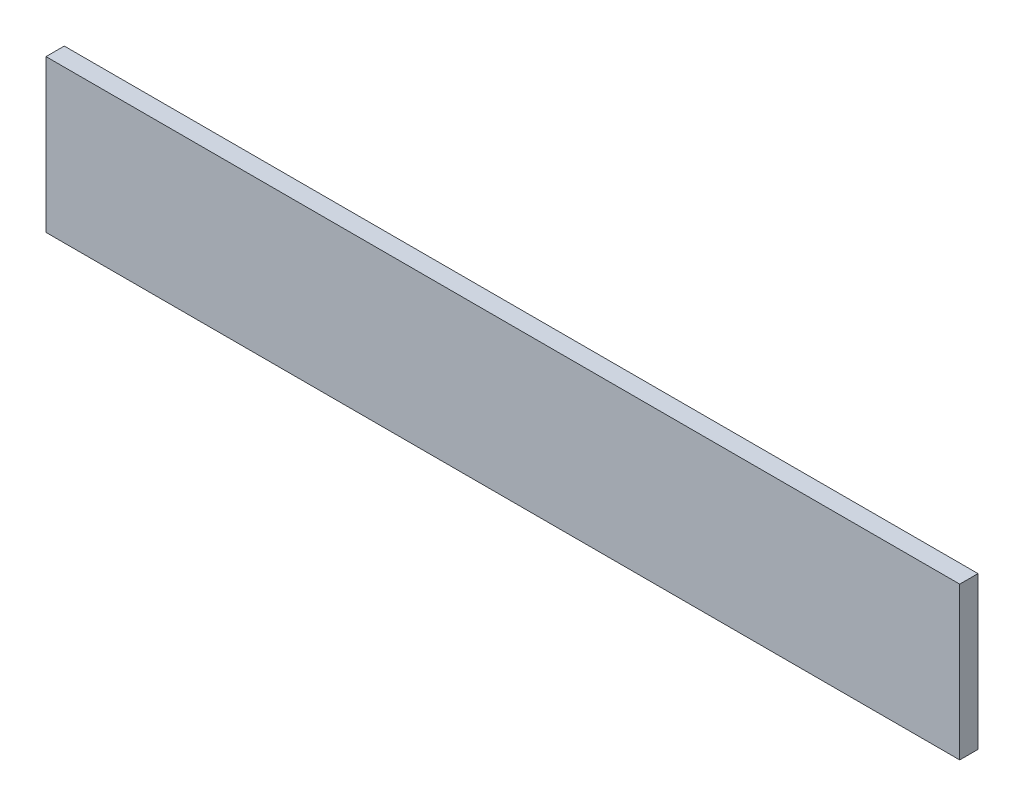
ISO-10303-21;
HEADER;
FILE_DESCRIPTION(('STEP AP214'),'2;1');
FILE_NAME('part.step','',(''),(''),'','','');
FILE_SCHEMA(('AUTOMOTIVE_DESIGN { 1 0 10303 214 1 1 1 1 }'));
ENDSEC;
DATA;
#1=APPLICATION_CONTEXT('core data for automotive mechanical design processes');
#2=APPLICATION_PROTOCOL_DEFINITION('international standard','automotive_design',2000,#1);
#3=PRODUCT_CONTEXT('',#1,'mechanical');
#4=PRODUCT('Part','Part','',(#3));
#5=PRODUCT_RELATED_PRODUCT_CATEGORY('part','',(#4));
#6=PRODUCT_DEFINITION_FORMATION('','',#4);
#7=PRODUCT_DEFINITION_CONTEXT('part definition',#1,'design');
#8=PRODUCT_DEFINITION('design','',#6,#7);
#9=PRODUCT_DEFINITION_SHAPE('','',#8);
#10=(LENGTH_UNIT() NAMED_UNIT(*) SI_UNIT(.MILLI.,.METRE.));
#11=(NAMED_UNIT(*) PLANE_ANGLE_UNIT() SI_UNIT($,.RADIAN.));
#12=(NAMED_UNIT(*) SI_UNIT($,.STERADIAN.) SOLID_ANGLE_UNIT());
#13=UNCERTAINTY_MEASURE_WITH_UNIT(LENGTH_MEASURE(1.E-05),#10,'distance_accuracy_value','');
#14=(GEOMETRIC_REPRESENTATION_CONTEXT(3) GLOBAL_UNCERTAINTY_ASSIGNED_CONTEXT((#13)) GLOBAL_UNIT_ASSIGNED_CONTEXT((#10,
#11,#12)) REPRESENTATION_CONTEXT('',''));
#15=CARTESIAN_POINT('',(0.,0.,0.));
#16=DIRECTION('',(0.,0.,1.));
#17=DIRECTION('',(1.,0.,0.));
#18=AXIS2_PLACEMENT_3D('',#15,#16,#17);
#19=CARTESIAN_POINT('',(-150.,50.,6.));
#20=DIRECTION('',(1.,0.,0.));
#21=DIRECTION('',(0.,0.,-1.));
#22=AXIS2_PLACEMENT_3D('',#19,#20,#21);
#23=PLANE('',#22);
#24=DIRECTION('',(0.,-1.,0.));
#25=VECTOR('',#24,1.);
#26=CARTESIAN_POINT('',(-150.,50.,0.));
#27=LINE('',#26,#25);
#28=CARTESIAN_POINT('',(-150.,50.,0.));
#29=VERTEX_POINT('',#28);
#30=CARTESIAN_POINT('',(-150.,0.,0.));
#31=VERTEX_POINT('',#30);
#32=EDGE_CURVE('E70',#29,#31,#27,.T.);
#33=ORIENTED_EDGE('',*,*,#32,.T.);
#34=DIRECTION('',(0.,0.,-1.));
#35=VECTOR('',#34,1.);
#36=CARTESIAN_POINT('',(-150.,0.,6.));
#37=LINE('',#36,#35);
#38=CARTESIAN_POINT('',(-150.,0.,6.));
#39=VERTEX_POINT('',#38);
#40=EDGE_CURVE('E11',#39,#31,#37,.T.);
#41=ORIENTED_EDGE('',*,*,#40,.F.);
#42=DIRECTION('',(0.,-1.,0.));
#43=VECTOR('',#42,1.);
#44=CARTESIAN_POINT('',(-150.,50.,6.));
#45=LINE('',#44,#43);
#46=CARTESIAN_POINT('',(-150.,50.,6.));
#47=VERTEX_POINT('',#46);
#48=EDGE_CURVE('E88',#47,#39,#45,.T.);
#49=ORIENTED_EDGE('',*,*,#48,.F.);
#50=DIRECTION('',(0.,0.,-1.));
#51=VECTOR('',#50,1.);
#52=CARTESIAN_POINT('',(-150.,50.,6.));
#53=LINE('',#52,#51);
#54=EDGE_CURVE('E82',#47,#29,#53,.T.);
#55=ORIENTED_EDGE('',*,*,#54,.T.);
#56=EDGE_LOOP('',(#33,#41,#49,#55));
#57=FACE_BOUND('',#56,.T.);
#58=ADVANCED_FACE('F26',(#57),#23,.F.);
#59=CARTESIAN_POINT('',(-150.,0.,6.));
#60=DIRECTION('',(0.,1.,0.));
#61=DIRECTION('',(0.,0.,1.));
#62=AXIS2_PLACEMENT_3D('',#59,#60,#61);
#63=PLANE('',#62);
#64=DIRECTION('',(1.,0.,0.));
#65=VECTOR('',#64,1.);
#66=CARTESIAN_POINT('',(-150.,0.,0.));
#67=LINE('',#66,#65);
#68=CARTESIAN_POINT('',(150.,0.,0.));
#69=VERTEX_POINT('',#68);
#70=EDGE_CURVE('E66',#31,#69,#67,.T.);
#71=ORIENTED_EDGE('',*,*,#70,.T.);
#72=DIRECTION('',(0.,0.,-1.));
#73=VECTOR('',#72,1.);
#74=CARTESIAN_POINT('',(150.,0.,6.));
#75=LINE('',#74,#73);
#76=CARTESIAN_POINT('',(150.,0.,6.));
#77=VERTEX_POINT('',#76);
#78=EDGE_CURVE('E33',#77,#69,#75,.T.);
#79=ORIENTED_EDGE('',*,*,#78,.F.);
#80=DIRECTION('',(1.,0.,0.));
#81=VECTOR('',#80,1.);
#82=CARTESIAN_POINT('',(-150.,0.,6.));
#83=LINE('',#82,#81);
#84=EDGE_CURVE('E78',#39,#77,#83,.T.);
#85=ORIENTED_EDGE('',*,*,#84,.F.);
#86=ORIENTED_EDGE('',*,*,#40,.T.);
#87=EDGE_LOOP('',(#71,#79,#85,#86));
#88=FACE_BOUND('',#87,.T.);
#89=ADVANCED_FACE('F77',(#88),#63,.F.);
#90=CARTESIAN_POINT('',(150.,50.,6.));
#91=DIRECTION('',(-1.,0.,0.));
#92=DIRECTION('',(0.,0.,1.));
#93=AXIS2_PLACEMENT_3D('',#90,#91,#92);
#94=PLANE('',#93);
#95=DIRECTION('',(0.,1.,0.));
#96=VECTOR('',#95,1.);
#97=CARTESIAN_POINT('',(150.,50.,0.));
#98=LINE('',#97,#96);
#99=CARTESIAN_POINT('',(150.,50.,0.));
#100=VERTEX_POINT('',#99);
#101=EDGE_CURVE('E71',#69,#100,#98,.T.);
#102=ORIENTED_EDGE('',*,*,#101,.T.);
#103=DIRECTION('',(0.,0.,-1.));
#104=VECTOR('',#103,1.);
#105=CARTESIAN_POINT('',(150.,50.,6.));
#106=LINE('',#105,#104);
#107=CARTESIAN_POINT('',(150.,50.,6.));
#108=VERTEX_POINT('',#107);
#109=EDGE_CURVE('E94',#108,#100,#106,.T.);
#110=ORIENTED_EDGE('',*,*,#109,.F.);
#111=DIRECTION('',(0.,1.,0.));
#112=VECTOR('',#111,1.);
#113=CARTESIAN_POINT('',(150.,50.,6.));
#114=LINE('',#113,#112);
#115=EDGE_CURVE('E45',#77,#108,#114,.T.);
#116=ORIENTED_EDGE('',*,*,#115,.F.);
#117=ORIENTED_EDGE('',*,*,#78,.T.);
#118=EDGE_LOOP('',(#102,#110,#116,#117));
#119=FACE_BOUND('',#118,.T.);
#120=ADVANCED_FACE('F97',(#119),#94,.F.);
#121=CARTESIAN_POINT('',(-150.,50.,6.));
#122=DIRECTION('',(0.,-1.,0.));
#123=DIRECTION('',(0.,0.,-1.));
#124=AXIS2_PLACEMENT_3D('',#121,#122,#123);
#125=PLANE('',#124);
#126=DIRECTION('',(-1.,0.,0.));
#127=VECTOR('',#126,1.);
#128=CARTESIAN_POINT('',(-150.,50.,0.));
#129=LINE('',#128,#127);
#130=EDGE_CURVE('E86',#100,#29,#129,.T.);
#131=ORIENTED_EDGE('',*,*,#130,.T.);
#132=ORIENTED_EDGE('',*,*,#54,.F.);
#133=DIRECTION('',(-1.,0.,0.));
#134=VECTOR('',#133,1.);
#135=CARTESIAN_POINT('',(-150.,50.,6.));
#136=LINE('',#135,#134);
#137=EDGE_CURVE('E40',#108,#47,#136,.T.);
#138=ORIENTED_EDGE('',*,*,#137,.F.);
#139=ORIENTED_EDGE('',*,*,#109,.T.);
#140=EDGE_LOOP('',(#131,#132,#138,#139));
#141=FACE_BOUND('',#140,.T.);
#142=ADVANCED_FACE('F99',(#141),#125,.F.);
#143=CARTESIAN_POINT('',(-150.,0.,6.));
#144=DIRECTION('',(0.,0.,1.));
#145=DIRECTION('',(1.,0.,0.));
#146=AXIS2_PLACEMENT_3D('',#143,#144,#145);
#147=PLANE('',#146);
#148=ORIENTED_EDGE('',*,*,#48,.T.);
#149=ORIENTED_EDGE('',*,*,#84,.T.);
#150=ORIENTED_EDGE('',*,*,#115,.T.);
#151=ORIENTED_EDGE('',*,*,#137,.T.);
#152=EDGE_LOOP('',(#148,#149,#150,#151));
#153=FACE_BOUND('',#152,.T.);
#154=ADVANCED_FACE('F100',(#153),#147,.T.);
#155=CARTESIAN_POINT('',(-150.,0.,0.));
#156=DIRECTION('',(0.,0.,1.));
#157=DIRECTION('',(1.,0.,0.));
#158=AXIS2_PLACEMENT_3D('',#155,#156,#157);
#159=PLANE('',#158);
#160=ORIENTED_EDGE('',*,*,#32,.F.);
#161=ORIENTED_EDGE('',*,*,#130,.F.);
#162=ORIENTED_EDGE('',*,*,#101,.F.);
#163=ORIENTED_EDGE('',*,*,#70,.F.);
#164=EDGE_LOOP('',(#160,#161,#162,#163));
#165=FACE_BOUND('',#164,.T.);
#166=ADVANCED_FACE('F67',(#165),#159,.F.);
#167=CLOSED_SHELL('',(#58,#89,#120,#142,#154,#166));
#168=MANIFOLD_SOLID_BREP('B2',#167);
#169=ADVANCED_BREP_SHAPE_REPRESENTATION('',(#18,#168),#14);
#170=SHAPE_DEFINITION_REPRESENTATION(#9,#169);
ENDSEC;
END-ISO-10303-21;
